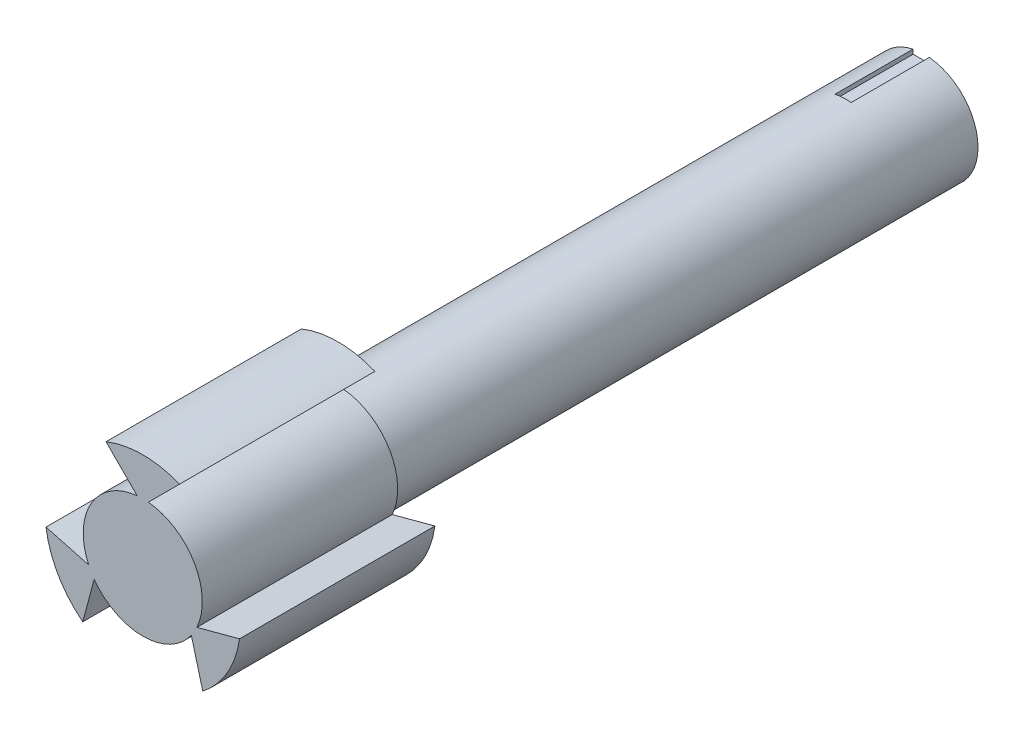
ISO-10303-21;
HEADER;
FILE_DESCRIPTION(('STEP AP214'),'2;1');
FILE_NAME('part.step','',(''),(''),'','','');
FILE_SCHEMA(('AUTOMOTIVE_DESIGN { 1 0 10303 214 1 1 1 1 }'));
ENDSEC;
DATA;
#1=APPLICATION_CONTEXT('core data for automotive mechanical design processes');
#2=APPLICATION_PROTOCOL_DEFINITION('international standard','automotive_design',2000,#1);
#3=PRODUCT_CONTEXT('',#1,'mechanical');
#4=PRODUCT('Part','Part','',(#3));
#5=PRODUCT_RELATED_PRODUCT_CATEGORY('part','',(#4));
#6=PRODUCT_DEFINITION_FORMATION('','',#4);
#7=PRODUCT_DEFINITION_CONTEXT('part definition',#1,'design');
#8=PRODUCT_DEFINITION('design','',#6,#7);
#9=PRODUCT_DEFINITION_SHAPE('','',#8);
#10=(LENGTH_UNIT() NAMED_UNIT(*) SI_UNIT(.MILLI.,.METRE.));
#11=(NAMED_UNIT(*) PLANE_ANGLE_UNIT() SI_UNIT($,.RADIAN.));
#12=(NAMED_UNIT(*) SI_UNIT($,.STERADIAN.) SOLID_ANGLE_UNIT());
#13=UNCERTAINTY_MEASURE_WITH_UNIT(LENGTH_MEASURE(1.E-05),#10,'distance_accuracy_value','');
#14=(GEOMETRIC_REPRESENTATION_CONTEXT(3) GLOBAL_UNCERTAINTY_ASSIGNED_CONTEXT((#13)) GLOBAL_UNIT_ASSIGNED_CONTEXT((#10,
#11,#12)) REPRESENTATION_CONTEXT('',''));
#15=CARTESIAN_POINT('',(0.,0.,0.));
#16=DIRECTION('',(0.,0.,1.));
#17=DIRECTION('',(1.,0.,0.));
#18=AXIS2_PLACEMENT_3D('',#15,#16,#17);
#19=CARTESIAN_POINT('',(0.,0.,200.));
#20=DIRECTION('',(0.,0.,-1.));
#21=DIRECTION('',(-1.,0.,0.));
#22=AXIS2_PLACEMENT_3D('',#19,#20,#21);
#23=CYLINDRICAL_SURFACE('',#22,100.);
#24=CARTESIAN_POINT('',(0.,0.,0.));
#25=DIRECTION('',(0.,0.,1.));
#26=DIRECTION('',(1.,0.,0.));
#27=AXIS2_PLACEMENT_3D('',#24,#25,#26);
#28=CIRCLE('',#27,100.);
#29=CARTESIAN_POINT('',(37.6440711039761,92.6440711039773,0.));
#30=VERTEX_POINT('',#29);
#31=CARTESIAN_POINT('',(-37.644071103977,92.6440711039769,0.));
#32=VERTEX_POINT('',#31);
#33=EDGE_CURVE('E167',#30,#32,#28,.T.);
#34=ORIENTED_EDGE('',*,*,#33,.T.);
#35=DIRECTION('',(0.,0.,-1.));
#36=VECTOR('',#35,1.);
#37=CARTESIAN_POINT('',(-37.644071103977,92.6440711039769,200.));
#38=LINE('',#37,#36);
#39=CARTESIAN_POINT('',(-37.644071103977,92.6440711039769,200.));
#40=VERTEX_POINT('',#39);
#41=EDGE_CURVE('E216',#40,#32,#38,.T.);
#42=ORIENTED_EDGE('',*,*,#41,.F.);
#43=CARTESIAN_POINT('',(0.,0.,200.));
#44=DIRECTION('',(0.,0.,1.));
#45=DIRECTION('',(1.,0.,0.));
#46=AXIS2_PLACEMENT_3D('',#43,#44,#45);
#47=CIRCLE('',#46,100.);
#48=CARTESIAN_POINT('',(37.6440711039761,92.6440711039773,200.));
#49=VERTEX_POINT('',#48);
#50=EDGE_CURVE('E109',#49,#40,#47,.T.);
#51=ORIENTED_EDGE('',*,*,#50,.F.);
#52=DIRECTION('',(0.,0.,-1.));
#53=VECTOR('',#52,1.);
#54=CARTESIAN_POINT('',(37.6440711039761,92.6440711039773,200.));
#55=LINE('',#54,#53);
#56=EDGE_CURVE('E166',#49,#30,#55,.T.);
#57=ORIENTED_EDGE('',*,*,#56,.T.);
#58=EDGE_LOOP('',(#34,#42,#51,#57));
#59=FACE_BOUND('',#58,.T.);
#60=ADVANCED_FACE('F35',(#59),#23,.T.);
#61=CARTESIAN_POINT('',(27.5,27.5000000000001,200.));
#62=DIRECTION('',(-0.707106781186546,-0.707106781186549,0.));
#63=DIRECTION('',(0.707106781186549,-0.707106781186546,0.));
#64=AXIS2_PLACEMENT_3D('',#61,#62,#63);
#65=PLANE('',#64);
#66=DIRECTION('',(-0.707106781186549,0.707106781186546,0.));
#67=VECTOR('',#66,1.);
#68=CARTESIAN_POINT('',(27.5,27.5000000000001,0.));
#69=LINE('',#68,#67);
#70=CARTESIAN_POINT('',(-5.67814722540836,60.6781472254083,0.));
#71=VERTEX_POINT('',#70);
#72=EDGE_CURVE('E170',#71,#32,#69,.T.);
#73=ORIENTED_EDGE('',*,*,#72,.F.);
#74=DIRECTION('',(0.,0.,-1.));
#75=VECTOR('',#74,1.);
#76=CARTESIAN_POINT('',(-5.67814722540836,60.6781472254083,200.));
#77=LINE('',#76,#75);
#78=CARTESIAN_POINT('',(-5.67814722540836,60.6781472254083,200.));
#79=VERTEX_POINT('',#78);
#80=EDGE_CURVE('E214',#79,#71,#77,.T.);
#81=ORIENTED_EDGE('',*,*,#80,.F.);
#82=DIRECTION('',(-0.707106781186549,0.707106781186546,0.));
#83=VECTOR('',#82,1.);
#84=CARTESIAN_POINT('',(27.5,27.5000000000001,200.));
#85=LINE('',#84,#83);
#86=EDGE_CURVE('E247',#79,#40,#85,.T.);
#87=ORIENTED_EDGE('',*,*,#86,.T.);
#88=ORIENTED_EDGE('',*,*,#41,.T.);
#89=EDGE_LOOP('',(#73,#81,#87,#88));
#90=FACE_BOUND('',#89,.T.);
#91=ADVANCED_FACE('F278',(#90),#65,.T.);
#92=CARTESIAN_POINT('',(0.,0.,200.));
#93=DIRECTION('',(0.,0.,-1.));
#94=DIRECTION('',(-1.,0.,0.));
#95=AXIS2_PLACEMENT_3D('',#92,#93,#94);
#96=CYLINDRICAL_SURFACE('',#95,60.9432433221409);
#97=CARTESIAN_POINT('',(0.,0.,0.));
#98=DIRECTION('',(0.,0.,1.));
#99=DIRECTION('',(1.,0.,0.));
#100=AXIS2_PLACEMENT_3D('',#97,#98,#99);
#101=CIRCLE('',#100,60.9432433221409);
#102=CARTESIAN_POINT('',(-55.3878905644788,-25.4216538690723,0.));
#103=VERTEX_POINT('',#102);
#104=EDGE_CURVE('E174',#71,#103,#101,.T.);
#105=ORIENTED_EDGE('',*,*,#104,.T.);
#106=DIRECTION('',(0.,0.,-1.));
#107=VECTOR('',#106,1.);
#108=CARTESIAN_POINT('',(-55.3878905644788,-25.4216538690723,200.));
#109=LINE('',#108,#107);
#110=CARTESIAN_POINT('',(-55.3878905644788,-25.4216538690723,200.));
#111=VERTEX_POINT('',#110);
#112=EDGE_CURVE('E211',#111,#103,#109,.T.);
#113=ORIENTED_EDGE('',*,*,#112,.F.);
#114=CARTESIAN_POINT('',(0.,0.,200.));
#115=DIRECTION('',(0.,0.,1.));
#116=DIRECTION('',(1.,0.,0.));
#117=AXIS2_PLACEMENT_3D('',#114,#115,#116);
#118=CIRCLE('',#117,60.9432433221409);
#119=EDGE_CURVE('E250',#79,#111,#118,.T.);
#120=ORIENTED_EDGE('',*,*,#119,.F.);
#121=ORIENTED_EDGE('',*,*,#80,.T.);
#122=EDGE_LOOP('',(#105,#113,#120,#121));
#123=FACE_BOUND('',#122,.T.);
#124=ADVANCED_FACE('F284',(#123),#96,.T.);
#125=CARTESIAN_POINT('',(-10.0656986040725,-37.565698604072,200.));
#126=DIRECTION('',(-0.258819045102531,-0.965925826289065,0.));
#127=DIRECTION('',(0.965925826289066,-0.258819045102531,0.));
#128=AXIS2_PLACEMENT_3D('',#125,#126,#127);
#129=PLANE('',#128);
#130=DIRECTION('',(-0.965925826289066,0.258819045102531,0.));
#131=VECTOR('',#130,1.);
#132=CARTESIAN_POINT('',(-10.0656986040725,-37.565698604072,0.));
#133=LINE('',#132,#131);
#134=CARTESIAN_POINT('',(-99.0541546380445,-13.7213136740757,0.));
#135=VERTEX_POINT('',#134);
#136=EDGE_CURVE('E176',#103,#135,#133,.T.);
#137=ORIENTED_EDGE('',*,*,#136,.T.);
#138=DIRECTION('',(0.,0.,-1.));
#139=VECTOR('',#138,1.);
#140=CARTESIAN_POINT('',(-99.0541546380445,-13.7213136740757,200.));
#141=LINE('',#140,#139);
#142=CARTESIAN_POINT('',(-99.0541546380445,-13.7213136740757,200.));
#143=VERTEX_POINT('',#142);
#144=EDGE_CURVE('E208',#143,#135,#141,.T.);
#145=ORIENTED_EDGE('',*,*,#144,.F.);
#146=DIRECTION('',(-0.965925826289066,0.258819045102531,0.));
#147=VECTOR('',#146,1.);
#148=CARTESIAN_POINT('',(-10.0656986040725,-37.565698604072,200.));
#149=LINE('',#148,#147);
#150=EDGE_CURVE('E252',#111,#143,#149,.T.);
#151=ORIENTED_EDGE('',*,*,#150,.F.);
#152=ORIENTED_EDGE('',*,*,#112,.T.);
#153=EDGE_LOOP('',(#137,#145,#151,#152));
#154=FACE_BOUND('',#153,.T.);
#155=ADVANCED_FACE('F288',(#154),#129,.F.);
#156=CARTESIAN_POINT('',(0.,0.,200.));
#157=DIRECTION('',(0.,0.,-1.));
#158=DIRECTION('',(-1.,0.,0.));
#159=AXIS2_PLACEMENT_3D('',#156,#157,#158);
#160=CYLINDRICAL_SURFACE('',#159,100.);
#161=CARTESIAN_POINT('',(0.,0.,0.));
#162=DIRECTION('',(0.,0.,1.));
#163=DIRECTION('',(1.,0.,0.));
#164=AXIS2_PLACEMENT_3D('',#161,#162,#163);
#165=CIRCLE('',#164,100.);
#166=CARTESIAN_POINT('',(-61.410083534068,-78.9227574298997,0.));
#167=VERTEX_POINT('',#166);
#168=EDGE_CURVE('E178',#135,#167,#165,.T.);
#169=ORIENTED_EDGE('',*,*,#168,.T.);
#170=DIRECTION('',(0.,0.,-1.));
#171=VECTOR('',#170,1.);
#172=CARTESIAN_POINT('',(-61.410083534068,-78.9227574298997,200.));
#173=LINE('',#172,#171);
#174=CARTESIAN_POINT('',(-61.410083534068,-78.9227574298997,200.));
#175=VERTEX_POINT('',#174);
#176=EDGE_CURVE('E206',#175,#167,#173,.T.);
#177=ORIENTED_EDGE('',*,*,#176,.F.);
#178=CARTESIAN_POINT('',(0.,0.,200.));
#179=DIRECTION('',(0.,0.,1.));
#180=DIRECTION('',(1.,0.,0.));
#181=AXIS2_PLACEMENT_3D('',#178,#179,#180);
#182=CIRCLE('',#181,100.);
#183=EDGE_CURVE('E254',#143,#175,#182,.T.);
#184=ORIENTED_EDGE('',*,*,#183,.F.);
#185=ORIENTED_EDGE('',*,*,#144,.T.);
#186=EDGE_LOOP('',(#169,#177,#184,#185));
#187=FACE_BOUND('',#186,.T.);
#188=ADVANCED_FACE('F293',(#187),#160,.T.);
#189=CARTESIAN_POINT('',(-37.5656986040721,10.0656986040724,200.));
#190=DIRECTION('',(0.965925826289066,-0.258819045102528,0.));
#191=DIRECTION('',(0.258819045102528,0.965925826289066,0.));
#192=AXIS2_PLACEMENT_3D('',#189,#190,#191);
#193=PLANE('',#192);
#194=DIRECTION('',(-0.258819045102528,-0.965925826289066,0.));
#195=VECTOR('',#194,1.);
#196=CARTESIAN_POINT('',(-37.5656986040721,10.0656986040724,0.));
#197=LINE('',#196,#195);
#198=CARTESIAN_POINT('',(-49.7097433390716,-35.256493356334,0.));
#199=VERTEX_POINT('',#198);
#200=EDGE_CURVE('E181',#199,#167,#197,.T.);
#201=ORIENTED_EDGE('',*,*,#200,.F.);
#202=DIRECTION('',(0.,0.,-1.));
#203=VECTOR('',#202,1.);
#204=CARTESIAN_POINT('',(-49.7097433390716,-35.256493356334,200.));
#205=LINE('',#204,#203);
#206=CARTESIAN_POINT('',(-49.7097433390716,-35.256493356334,200.));
#207=VERTEX_POINT('',#206);
#208=EDGE_CURVE('E204',#207,#199,#205,.T.);
#209=ORIENTED_EDGE('',*,*,#208,.F.);
#210=DIRECTION('',(-0.258819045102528,-0.965925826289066,0.));
#211=VECTOR('',#210,1.);
#212=CARTESIAN_POINT('',(-37.5656986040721,10.0656986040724,200.));
#213=LINE('',#212,#211);
#214=EDGE_CURVE('E256',#207,#175,#213,.T.);
#215=ORIENTED_EDGE('',*,*,#214,.T.);
#216=ORIENTED_EDGE('',*,*,#176,.T.);
#217=EDGE_LOOP('',(#201,#209,#215,#216));
#218=FACE_BOUND('',#217,.T.);
#219=ADVANCED_FACE('F296',(#218),#193,.T.);
#220=CARTESIAN_POINT('',(0.,0.,200.));
#221=DIRECTION('',(0.,0.,-1.));
#222=DIRECTION('',(-1.,0.,0.));
#223=AXIS2_PLACEMENT_3D('',#220,#221,#222);
#224=CYLINDRICAL_SURFACE('',#223,60.9432433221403);
#225=CARTESIAN_POINT('',(0.,0.,0.));
#226=DIRECTION('',(0.,0.,1.));
#227=DIRECTION('',(1.,0.,0.));
#228=AXIS2_PLACEMENT_3D('',#225,#226,#227);
#229=CIRCLE('',#228,60.9432433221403);
#230=CARTESIAN_POINT('',(49.7097433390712,-35.2564933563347,0.));
#231=VERTEX_POINT('',#230);
#232=EDGE_CURVE('E184',#199,#231,#229,.T.);
#233=ORIENTED_EDGE('',*,*,#232,.T.);
#234=DIRECTION('',(0.,0.,-1.));
#235=VECTOR('',#234,1.);
#236=CARTESIAN_POINT('',(49.7097433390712,-35.2564933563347,200.));
#237=LINE('',#236,#235);
#238=CARTESIAN_POINT('',(49.7097433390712,-35.2564933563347,200.));
#239=VERTEX_POINT('',#238);
#240=EDGE_CURVE('E201',#239,#231,#237,.T.);
#241=ORIENTED_EDGE('',*,*,#240,.F.);
#242=CARTESIAN_POINT('',(0.,0.,200.));
#243=DIRECTION('',(0.,0.,1.));
#244=DIRECTION('',(1.,0.,0.));
#245=AXIS2_PLACEMENT_3D('',#242,#243,#244);
#246=CIRCLE('',#245,60.9432433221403);
#247=EDGE_CURVE('E259',#207,#239,#246,.T.);
#248=ORIENTED_EDGE('',*,*,#247,.F.);
#249=ORIENTED_EDGE('',*,*,#208,.T.);
#250=EDGE_LOOP('',(#233,#241,#248,#249));
#251=FACE_BOUND('',#250,.T.);
#252=ADVANCED_FACE('F299',(#251),#224,.T.);
#253=CARTESIAN_POINT('',(37.5656986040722,10.0656986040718,200.));
#254=DIRECTION('',(0.96592582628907,0.258819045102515,0.));
#255=DIRECTION('',(-0.258819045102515,0.96592582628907,0.));
#256=AXIS2_PLACEMENT_3D('',#253,#254,#255);
#257=PLANE('',#256);
#258=DIRECTION('',(0.258819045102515,-0.96592582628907,0.));
#259=VECTOR('',#258,1.);
#260=CARTESIAN_POINT('',(37.5656986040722,10.0656986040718,0.));
#261=LINE('',#260,#259);
#262=CARTESIAN_POINT('',(61.410083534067,-78.9227574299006,0.));
#263=VERTEX_POINT('',#262);
#264=EDGE_CURVE('E186',#231,#263,#261,.T.);
#265=ORIENTED_EDGE('',*,*,#264,.T.);
#266=DIRECTION('',(0.,0.,-1.));
#267=VECTOR('',#266,1.);
#268=CARTESIAN_POINT('',(61.410083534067,-78.9227574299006,200.));
#269=LINE('',#268,#267);
#270=CARTESIAN_POINT('',(61.410083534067,-78.9227574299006,200.));
#271=VERTEX_POINT('',#270);
#272=EDGE_CURVE('E198',#271,#263,#269,.T.);
#273=ORIENTED_EDGE('',*,*,#272,.F.);
#274=DIRECTION('',(0.258819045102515,-0.96592582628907,0.));
#275=VECTOR('',#274,1.);
#276=CARTESIAN_POINT('',(37.5656986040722,10.0656986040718,200.));
#277=LINE('',#276,#275);
#278=EDGE_CURVE('E161',#239,#271,#277,.T.);
#279=ORIENTED_EDGE('',*,*,#278,.F.);
#280=ORIENTED_EDGE('',*,*,#240,.T.);
#281=EDGE_LOOP('',(#265,#273,#279,#280));
#282=FACE_BOUND('',#281,.T.);
#283=ADVANCED_FACE('F266',(#282),#257,.F.);
#284=CARTESIAN_POINT('',(0.,0.,200.));
#285=DIRECTION('',(0.,0.,-1.));
#286=DIRECTION('',(-1.,0.,0.));
#287=AXIS2_PLACEMENT_3D('',#284,#285,#286);
#288=CYLINDRICAL_SURFACE('',#287,100.);
#289=CARTESIAN_POINT('',(0.,0.,0.));
#290=DIRECTION('',(0.,0.,1.));
#291=DIRECTION('',(1.,0.,0.));
#292=AXIS2_PLACEMENT_3D('',#289,#290,#291);
#293=CIRCLE('',#292,100.);
#294=CARTESIAN_POINT('',(99.0541546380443,-13.7213136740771,0.));
#295=VERTEX_POINT('',#294);
#296=EDGE_CURVE('E188',#263,#295,#293,.T.);
#297=ORIENTED_EDGE('',*,*,#296,.T.);
#298=DIRECTION('',(0.,0.,-1.));
#299=VECTOR('',#298,1.);
#300=CARTESIAN_POINT('',(99.0541546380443,-13.7213136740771,200.));
#301=LINE('',#300,#299);
#302=CARTESIAN_POINT('',(99.0541546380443,-13.7213136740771,200.));
#303=VERTEX_POINT('',#302);
#304=EDGE_CURVE('E149',#303,#295,#301,.T.);
#305=ORIENTED_EDGE('',*,*,#304,.F.);
#306=CARTESIAN_POINT('',(0.,0.,200.));
#307=DIRECTION('',(0.,0.,1.));
#308=DIRECTION('',(1.,0.,0.));
#309=AXIS2_PLACEMENT_3D('',#306,#307,#308);
#310=CIRCLE('',#309,100.);
#311=EDGE_CURVE('E158',#271,#303,#310,.T.);
#312=ORIENTED_EDGE('',*,*,#311,.F.);
#313=ORIENTED_EDGE('',*,*,#272,.T.);
#314=EDGE_LOOP('',(#297,#305,#312,#313));
#315=FACE_BOUND('',#314,.T.);
#316=ADVANCED_FACE('F270',(#315),#288,.T.);
#317=CARTESIAN_POINT('',(10.065698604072,-37.5656986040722,200.));
#318=DIRECTION('',(-0.258819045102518,0.965925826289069,0.));
#319=DIRECTION('',(-0.965925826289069,-0.258819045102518,0.));
#320=AXIS2_PLACEMENT_3D('',#317,#318,#319);
#321=PLANE('',#320);
#322=DIRECTION('',(0.965925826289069,0.258819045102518,0.));
#323=VECTOR('',#322,1.);
#324=CARTESIAN_POINT('',(10.065698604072,-37.5656986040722,0.));
#325=LINE('',#324,#323);
#326=CARTESIAN_POINT('',(55.3878905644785,-25.421653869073,0.));
#327=VERTEX_POINT('',#326);
#328=EDGE_CURVE('E146',#327,#295,#325,.T.);
#329=ORIENTED_EDGE('',*,*,#328,.F.);
#330=DIRECTION('',(0.,0.,-1.));
#331=VECTOR('',#330,1.);
#332=CARTESIAN_POINT('',(55.3878905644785,-25.421653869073,200.));
#333=LINE('',#332,#331);
#334=CARTESIAN_POINT('',(55.3878905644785,-25.421653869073,200.));
#335=VERTEX_POINT('',#334);
#336=EDGE_CURVE('E140',#335,#327,#333,.T.);
#337=ORIENTED_EDGE('',*,*,#336,.F.);
#338=DIRECTION('',(0.965925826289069,0.258819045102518,0.));
#339=VECTOR('',#338,1.);
#340=CARTESIAN_POINT('',(10.065698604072,-37.5656986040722,200.));
#341=LINE('',#340,#339);
#342=EDGE_CURVE('E144',#335,#303,#341,.T.);
#343=ORIENTED_EDGE('',*,*,#342,.T.);
#344=ORIENTED_EDGE('',*,*,#304,.T.);
#345=EDGE_LOOP('',(#329,#337,#343,#344));
#346=FACE_BOUND('',#345,.T.);
#347=ADVANCED_FACE('F142',(#346),#321,.T.);
#348=CARTESIAN_POINT('',(0.,0.,200.));
#349=DIRECTION('',(0.,0.,-1.));
#350=DIRECTION('',(-1.,0.,0.));
#351=AXIS2_PLACEMENT_3D('',#348,#349,#350);
#352=CYLINDRICAL_SURFACE('',#351,60.9432433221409);
#353=CARTESIAN_POINT('',(0.,0.,0.));
#354=DIRECTION('',(0.,0.,1.));
#355=DIRECTION('',(1.,0.,0.));
#356=AXIS2_PLACEMENT_3D('',#353,#354,#355);
#357=CIRCLE('',#356,60.9432433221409);
#358=CARTESIAN_POINT('',(5.67814722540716,60.6781472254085,0.));
#359=VERTEX_POINT('',#358);
#360=EDGE_CURVE('E192',#327,#359,#357,.T.);
#361=ORIENTED_EDGE('',*,*,#360,.T.);
#362=DIRECTION('',(0.,0.,-1.));
#363=VECTOR('',#362,1.);
#364=CARTESIAN_POINT('',(5.67814722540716,60.6781472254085,200.));
#365=LINE('',#364,#363);
#366=CARTESIAN_POINT('',(5.67814722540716,60.6781472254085,200.));
#367=VERTEX_POINT('',#366);
#368=EDGE_CURVE('E150',#367,#359,#365,.T.);
#369=ORIENTED_EDGE('',*,*,#368,.F.);
#370=CARTESIAN_POINT('',(0.,0.,200.));
#371=DIRECTION('',(0.,0.,1.));
#372=DIRECTION('',(1.,0.,0.));
#373=AXIS2_PLACEMENT_3D('',#370,#371,#372);
#374=CIRCLE('',#373,60.9432433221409);
#375=EDGE_CURVE('E153',#335,#367,#374,.T.);
#376=ORIENTED_EDGE('',*,*,#375,.F.);
#377=ORIENTED_EDGE('',*,*,#336,.T.);
#378=EDGE_LOOP('',(#361,#369,#376,#377));
#379=FACE_BOUND('',#378,.T.);
#380=ADVANCED_FACE('F154',(#379),#352,.T.);
#381=CARTESIAN_POINT('',(-27.5000000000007,27.5000000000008,200.));
#382=DIRECTION('',(-0.707106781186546,0.707106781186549,0.));
#383=DIRECTION('',(-0.707106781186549,-0.707106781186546,0.));
#384=AXIS2_PLACEMENT_3D('',#381,#382,#383);
#385=PLANE('',#384);
#386=DIRECTION('',(0.707106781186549,0.707106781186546,0.));
#387=VECTOR('',#386,1.);
#388=CARTESIAN_POINT('',(-27.5000000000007,27.5000000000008,0.));
#389=LINE('',#388,#387);
#390=EDGE_CURVE('E103',#359,#30,#389,.T.);
#391=ORIENTED_EDGE('',*,*,#390,.T.);
#392=ORIENTED_EDGE('',*,*,#56,.F.);
#393=DIRECTION('',(0.707106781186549,0.707106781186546,0.));
#394=VECTOR('',#393,1.);
#395=CARTESIAN_POINT('',(-27.5000000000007,27.5000000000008,200.));
#396=LINE('',#395,#394);
#397=EDGE_CURVE('E58',#367,#49,#396,.T.);
#398=ORIENTED_EDGE('',*,*,#397,.F.);
#399=ORIENTED_EDGE('',*,*,#368,.T.);
#400=EDGE_LOOP('',(#391,#392,#398,#399));
#401=FACE_BOUND('',#400,.T.);
#402=ADVANCED_FACE('F274',(#401),#385,.F.);
#403=CARTESIAN_POINT('',(0.,0.,200.));
#404=DIRECTION('',(0.,0.,1.));
#405=DIRECTION('',(1.,0.,0.));
#406=AXIS2_PLACEMENT_3D('',#403,#404,#405);
#407=PLANE('',#406);
#408=ORIENTED_EDGE('',*,*,#50,.T.);
#409=ORIENTED_EDGE('',*,*,#86,.F.);
#410=ORIENTED_EDGE('',*,*,#119,.T.);
#411=ORIENTED_EDGE('',*,*,#150,.T.);
#412=ORIENTED_EDGE('',*,*,#183,.T.);
#413=ORIENTED_EDGE('',*,*,#214,.F.);
#414=ORIENTED_EDGE('',*,*,#247,.T.);
#415=ORIENTED_EDGE('',*,*,#278,.T.);
#416=ORIENTED_EDGE('',*,*,#311,.T.);
#417=ORIENTED_EDGE('',*,*,#342,.F.);
#418=ORIENTED_EDGE('',*,*,#375,.T.);
#419=ORIENTED_EDGE('',*,*,#397,.T.);
#420=EDGE_LOOP('',(#408,#409,#410,#411,#412,#413,#414,#415,#416,#417,#418,#419));
#421=FACE_BOUND('',#420,.T.);
#422=ADVANCED_FACE('F156',(#421),#407,.T.);
#423=CARTESIAN_POINT('',(0.,0.,0.));
#424=DIRECTION('',(0.,0.,1.));
#425=DIRECTION('',(1.,0.,0.));
#426=AXIS2_PLACEMENT_3D('',#423,#424,#425);
#427=PLANE('',#426);
#428=CARTESIAN_POINT('',(0.,0.,0.));
#429=DIRECTION('',(0.,0.,1.));
#430=DIRECTION('',(1.,0.,0.));
#431=AXIS2_PLACEMENT_3D('',#428,#429,#430);
#432=CIRCLE('',#431,55.);
#433=CARTESIAN_POINT('',(55.,0.,0.));
#434=VERTEX_POINT('',#433);
#435=EDGE_CURVE('E171',#434,#434,#432,.T.);
#436=ORIENTED_EDGE('',*,*,#435,.T.);
#437=EDGE_LOOP('',(#436));
#438=FACE_BOUND('',#437,.T.);
#439=ORIENTED_EDGE('',*,*,#33,.F.);
#440=ORIENTED_EDGE('',*,*,#390,.F.);
#441=ORIENTED_EDGE('',*,*,#360,.F.);
#442=ORIENTED_EDGE('',*,*,#328,.T.);
#443=ORIENTED_EDGE('',*,*,#296,.F.);
#444=ORIENTED_EDGE('',*,*,#264,.F.);
#445=ORIENTED_EDGE('',*,*,#232,.F.);
#446=ORIENTED_EDGE('',*,*,#200,.T.);
#447=ORIENTED_EDGE('',*,*,#168,.F.);
#448=ORIENTED_EDGE('',*,*,#136,.F.);
#449=ORIENTED_EDGE('',*,*,#104,.F.);
#450=ORIENTED_EDGE('',*,*,#72,.T.);
#451=EDGE_LOOP('',(#439,#440,#441,#442,#443,#444,#445,#446,#447,#448,#449,#450));
#452=FACE_BOUND('',#451,.T.);
#453=ADVANCED_FACE('F273',(#438,#452),#427,.F.);
#454=CARTESIAN_POINT('',(0.,0.,-600.));
#455=DIRECTION('',(0.,0.,1.));
#456=DIRECTION('',(1.,0.,0.));
#457=AXIS2_PLACEMENT_3D('',#454,#455,#456);
#458=CYLINDRICAL_SURFACE('',#457,55.);
#459=DIRECTION('',(0.,0.,1.));
#460=VECTOR('',#459,1.);
#461=CARTESIAN_POINT('',(5.17845899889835,54.7556715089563,-600.));
#462=LINE('',#461,#460);
#463=CARTESIAN_POINT('',(5.17845899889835,54.7556715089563,-520.));
#464=VERTEX_POINT('',#463);
#465=CARTESIAN_POINT('',(5.17845899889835,54.7556715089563,-600.));
#466=VERTEX_POINT('',#465);
#467=EDGE_CURVE('E239',#464,#466,#462,.F.);
#468=ORIENTED_EDGE('',*,*,#467,.F.);
#469=CARTESIAN_POINT('',(0.,0.,-520.));
#470=DIRECTION('',(0.,0.,-1.));
#471=DIRECTION('',(-1.,0.,0.));
#472=AXIS2_PLACEMENT_3D('',#469,#470,#471);
#473=CIRCLE('',#472,55.);
#474=CARTESIAN_POINT('',(-11.4331180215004,53.7985484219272,-520.));
#475=VERTEX_POINT('',#474);
#476=EDGE_CURVE('E11',#464,#475,#473,.F.);
#477=ORIENTED_EDGE('',*,*,#476,.T.);
#478=DIRECTION('',(0.,0.,1.));
#479=VECTOR('',#478,1.);
#480=CARTESIAN_POINT('',(-11.4331180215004,53.7985484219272,-600.));
#481=LINE('',#480,#479);
#482=CARTESIAN_POINT('',(-11.4331180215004,53.7985484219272,-600.));
#483=VERTEX_POINT('',#482);
#484=EDGE_CURVE('E241',#483,#475,#481,.T.);
#485=ORIENTED_EDGE('',*,*,#484,.F.);
#486=CARTESIAN_POINT('',(0.,0.,-600.));
#487=DIRECTION('',(0.,0.,1.));
#488=DIRECTION('',(1.,0.,0.));
#489=AXIS2_PLACEMENT_3D('',#486,#487,#488);
#490=CIRCLE('',#489,55.);
#491=EDGE_CURVE('E219',#483,#466,#490,.T.);
#492=ORIENTED_EDGE('',*,*,#491,.T.);
#493=EDGE_LOOP('',(#468,#477,#485,#492));
#494=FACE_BOUND('',#493,.T.);
#495=ORIENTED_EDGE('',*,*,#435,.F.);
#496=EDGE_LOOP('',(#495));
#497=FACE_BOUND('',#496,.T.);
#498=ADVANCED_FACE('F237',(#494,#497),#458,.T.);
#499=CARTESIAN_POINT('',(0.,0.,-600.));
#500=DIRECTION('',(0.,0.,1.));
#501=DIRECTION('',(1.,0.,0.));
#502=AXIS2_PLACEMENT_3D('',#499,#500,#501);
#503=PLANE('',#502);
#504=DIRECTION('',(-1.,0.,0.));
#505=VECTOR('',#504,1.);
#506=CARTESIAN_POINT('',(5.17845899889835,49.2710315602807,-600.));
#507=LINE('',#506,#505);
#508=CARTESIAN_POINT('',(5.17845899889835,49.2710315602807,-600.));
#509=VERTEX_POINT('',#508);
#510=CARTESIAN_POINT('',(-11.4331180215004,49.2710315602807,-600.));
#511=VERTEX_POINT('',#510);
#512=EDGE_CURVE('E49',#509,#511,#507,.T.);
#513=ORIENTED_EDGE('',*,*,#512,.F.);
#514=DIRECTION('',(0.,1.,0.));
#515=VECTOR('',#514,1.);
#516=CARTESIAN_POINT('',(5.17845899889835,0.,-600.));
#517=LINE('',#516,#515);
#518=EDGE_CURVE('E42',#509,#466,#517,.T.);
#519=ORIENTED_EDGE('',*,*,#518,.T.);
#520=ORIENTED_EDGE('',*,*,#491,.F.);
#521=DIRECTION('',(0.,1.,0.));
#522=VECTOR('',#521,1.);
#523=CARTESIAN_POINT('',(-11.4331180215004,49.2710315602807,-600.));
#524=LINE('',#523,#522);
#525=EDGE_CURVE('E458',#511,#483,#524,.T.);
#526=ORIENTED_EDGE('',*,*,#525,.F.);
#527=EDGE_LOOP('',(#513,#519,#520,#526));
#528=FACE_BOUND('',#527,.T.);
#529=ADVANCED_FACE('F226',(#528),#503,.F.);
#530=CARTESIAN_POINT('',(5.17845899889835,49.2710315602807,-520.));
#531=DIRECTION('',(0.,-1.,0.));
#532=DIRECTION('',(0.,0.,-1.));
#533=AXIS2_PLACEMENT_3D('',#530,#531,#532);
#534=PLANE('',#533);
#535=ORIENTED_EDGE('',*,*,#512,.T.);
#536=DIRECTION('',(0.,0.,-1.));
#537=VECTOR('',#536,1.);
#538=CARTESIAN_POINT('',(-11.4331180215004,49.2710315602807,-520.));
#539=LINE('',#538,#537);
#540=CARTESIAN_POINT('',(-11.4331180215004,49.2710315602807,-520.));
#541=VERTEX_POINT('',#540);
#542=EDGE_CURVE('E452',#541,#511,#539,.T.);
#543=ORIENTED_EDGE('',*,*,#542,.F.);
#544=DIRECTION('',(-1.,0.,0.));
#545=VECTOR('',#544,1.);
#546=CARTESIAN_POINT('',(5.17845899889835,49.2710315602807,-520.));
#547=LINE('',#546,#545);
#548=CARTESIAN_POINT('',(5.17845899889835,49.2710315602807,-520.));
#549=VERTEX_POINT('',#548);
#550=EDGE_CURVE('E450',#549,#541,#547,.T.);
#551=ORIENTED_EDGE('',*,*,#550,.F.);
#552=DIRECTION('',(0.,0.,-1.));
#553=VECTOR('',#552,1.);
#554=CARTESIAN_POINT('',(5.17845899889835,49.2710315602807,-520.));
#555=LINE('',#554,#553);
#556=EDGE_CURVE('E455',#549,#509,#555,.T.);
#557=ORIENTED_EDGE('',*,*,#556,.T.);
#558=EDGE_LOOP('',(#535,#543,#551,#557));
#559=FACE_BOUND('',#558,.T.);
#560=ADVANCED_FACE('F401',(#559),#534,.F.);
#561=CARTESIAN_POINT('',(5.17845899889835,49.2710315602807,-520.));
#562=DIRECTION('',(1.,0.,0.));
#563=DIRECTION('',(0.,0.,-1.));
#564=AXIS2_PLACEMENT_3D('',#561,#562,#563);
#565=PLANE('',#564);
#566=ORIENTED_EDGE('',*,*,#467,.T.);
#567=ORIENTED_EDGE('',*,*,#518,.F.);
#568=ORIENTED_EDGE('',*,*,#556,.F.);
#569=DIRECTION('',(0.,-1.,0.));
#570=VECTOR('',#569,1.);
#571=CARTESIAN_POINT('',(5.17845899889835,49.2710315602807,-520.));
#572=LINE('',#571,#570);
#573=EDGE_CURVE('E446',#464,#549,#572,.T.);
#574=ORIENTED_EDGE('',*,*,#573,.F.);
#575=EDGE_LOOP('',(#566,#567,#568,#574));
#576=FACE_BOUND('',#575,.T.);
#577=ADVANCED_FACE('F409',(#576),#565,.F.);
#578=CARTESIAN_POINT('',(-11.4331180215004,49.2710315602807,-520.));
#579=DIRECTION('',(-1.,0.,0.));
#580=DIRECTION('',(0.,0.,1.));
#581=AXIS2_PLACEMENT_3D('',#578,#579,#580);
#582=PLANE('',#581);
#583=ORIENTED_EDGE('',*,*,#484,.T.);
#584=DIRECTION('',(0.,1.,0.));
#585=VECTOR('',#584,1.);
#586=CARTESIAN_POINT('',(-11.4331180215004,49.2710315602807,-520.));
#587=LINE('',#586,#585);
#588=EDGE_CURVE('E453',#541,#475,#587,.T.);
#589=ORIENTED_EDGE('',*,*,#588,.F.);
#590=ORIENTED_EDGE('',*,*,#542,.T.);
#591=ORIENTED_EDGE('',*,*,#525,.T.);
#592=EDGE_LOOP('',(#583,#589,#590,#591));
#593=FACE_BOUND('',#592,.T.);
#594=ADVANCED_FACE('F418',(#593),#582,.F.);
#595=CARTESIAN_POINT('',(0.,0.,-520.));
#596=DIRECTION('',(0.,0.,-1.));
#597=DIRECTION('',(-1.,0.,0.));
#598=AXIS2_PLACEMENT_3D('',#595,#596,#597);
#599=PLANE('',#598);
#600=ORIENTED_EDGE('',*,*,#573,.T.);
#601=ORIENTED_EDGE('',*,*,#550,.T.);
#602=ORIENTED_EDGE('',*,*,#588,.T.);
#603=ORIENTED_EDGE('',*,*,#476,.F.);
#604=EDGE_LOOP('',(#600,#601,#602,#603));
#605=FACE_BOUND('',#604,.T.);
#606=ADVANCED_FACE('F427',(#605),#599,.T.);
#607=CLOSED_SHELL('',(#60,#91,#124,#155,#188,#219,#252,#283,#316,#347,#380,#402,#422,#453,#498,
#529,#560,#577,#594,#606));
#608=MANIFOLD_SOLID_BREP('B2',#607);
#609=ADVANCED_BREP_SHAPE_REPRESENTATION('',(#18,#608),#14);
#610=SHAPE_DEFINITION_REPRESENTATION(#9,#609);
ENDSEC;
END-ISO-10303-21;
